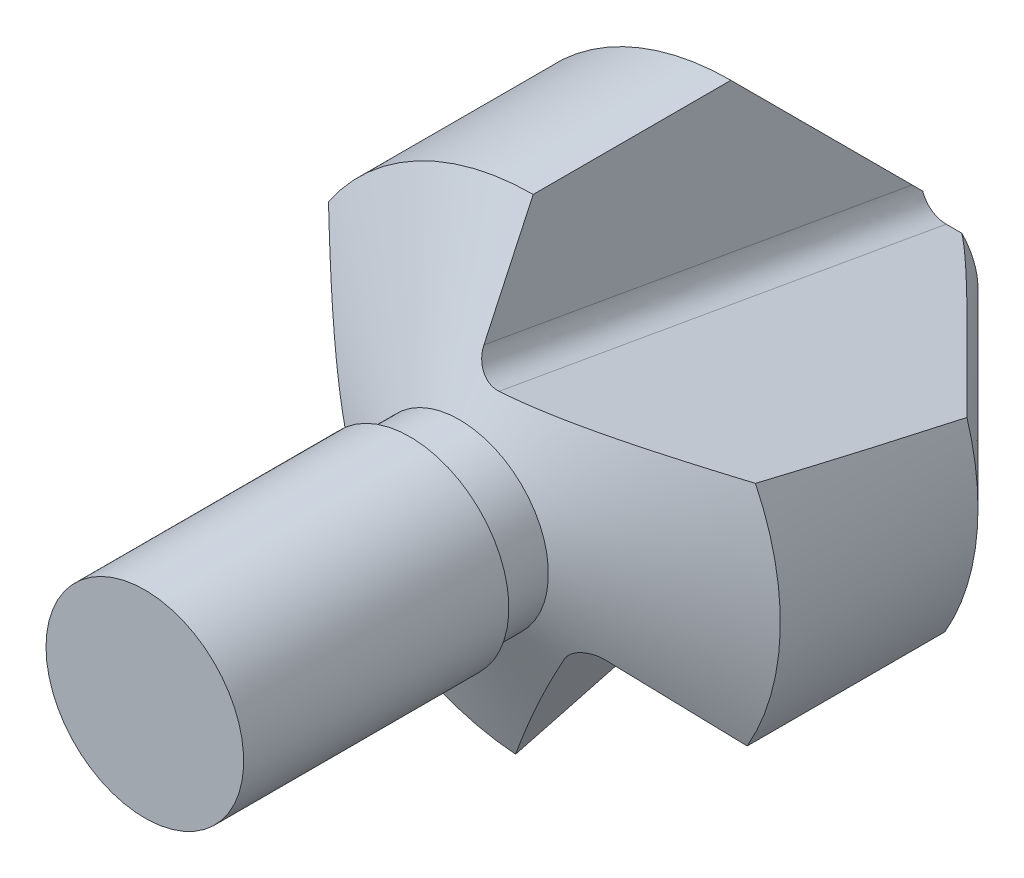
ISO-10303-21;
HEADER;
FILE_DESCRIPTION(('STEP AP214'),'2;1');
FILE_NAME('part.step','',(''),(''),'','','');
FILE_SCHEMA(('AUTOMOTIVE_DESIGN { 1 0 10303 214 1 1 1 1 }'));
ENDSEC;
DATA;
#1=APPLICATION_CONTEXT('core data for automotive mechanical design processes');
#2=APPLICATION_PROTOCOL_DEFINITION('international standard','automotive_design',2000,#1);
#3=PRODUCT_CONTEXT('',#1,'mechanical');
#4=PRODUCT('Part','Part','',(#3));
#5=PRODUCT_RELATED_PRODUCT_CATEGORY('part','',(#4));
#6=PRODUCT_DEFINITION_FORMATION('','',#4);
#7=PRODUCT_DEFINITION_CONTEXT('part definition',#1,'design');
#8=PRODUCT_DEFINITION('design','',#6,#7);
#9=PRODUCT_DEFINITION_SHAPE('','',#8);
#10=(LENGTH_UNIT() NAMED_UNIT(*) SI_UNIT(.MILLI.,.METRE.));
#11=(NAMED_UNIT(*) PLANE_ANGLE_UNIT() SI_UNIT($,.RADIAN.));
#12=(NAMED_UNIT(*) SI_UNIT($,.STERADIAN.) SOLID_ANGLE_UNIT());
#13=UNCERTAINTY_MEASURE_WITH_UNIT(LENGTH_MEASURE(1.E-05),#10,'distance_accuracy_value','');
#14=(GEOMETRIC_REPRESENTATION_CONTEXT(3) GLOBAL_UNCERTAINTY_ASSIGNED_CONTEXT((#13)) GLOBAL_UNIT_ASSIGNED_CONTEXT((#10,
#11,#12)) REPRESENTATION_CONTEXT('',''));
#15=CARTESIAN_POINT('',(0.,0.,0.));
#16=DIRECTION('',(0.,0.,1.));
#17=DIRECTION('',(1.,0.,0.));
#18=AXIS2_PLACEMENT_3D('',#15,#16,#17);
#19=CARTESIAN_POINT('',(0.,0.,-7.14285714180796E-08));
#20=DIRECTION('',(0.,0.,1.));
#21=DIRECTION('',(1.,0.,0.));
#22=AXIS2_PLACEMENT_3D('',#19,#20,#21);
#23=CONICAL_SURFACE('',#22,0.114285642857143,0.78539816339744);
#24=DIRECTION('',(0.612372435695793,0.353553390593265,-0.707106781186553));
#25=VECTOR('',#24,1.);
#26=CARTESIAN_POINT('',(0.,0.,-0.114285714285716));
#27=LINE('',#26,#25);
#28=CARTESIAN_POINT('',(-0.115496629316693,-0.0666820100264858,0.01907830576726));
#29=VERTEX_POINT('',#28);
#30=CARTESIAN_POINT('',(-0.433012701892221,-0.249999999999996,0.385714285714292));
#31=VERTEX_POINT('',#30);
#32=EDGE_CURVE('E202',#29,#31,#27,.F.);
#33=ORIENTED_EDGE('',*,*,#32,.F.);
#34=CARTESIAN_POINT('',(-0.100221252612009,-0.0549263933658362,-7.14285874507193E-08));
#35=CARTESIAN_POINT('',(-0.102285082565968,-0.056999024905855,0.00281137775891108));
#36=CARTESIAN_POINT('',(-0.104443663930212,-0.0589280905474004,0.00563666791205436));
#37=CARTESIAN_POINT('',(-0.109485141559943,-0.062922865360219,0.0119887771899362));
#38=CARTESIAN_POINT('',(-0.112418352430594,-0.0649123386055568,0.0155229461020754));
#39=CARTESIAN_POINT('',(-0.115496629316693,-0.0666820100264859,0.0190783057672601));
#40=B_SPLINE_CURVE_WITH_KNOTS('',3,(#34,#35,#36,#37,#38,#39),.UNSPECIFIED.,.F.,.F.,(4,2,4),(0.,
0.0121353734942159,0.0271509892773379),.UNSPECIFIED.);
#41=CARTESIAN_POINT('',(-0.100221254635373,-0.0549263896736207,0.));
#42=VERTEX_POINT('',#41);
#43=EDGE_CURVE('E195',#42,#29,#40,.T.);
#44=ORIENTED_EDGE('',*,*,#43,.F.);
#45=CARTESIAN_POINT('',(0.,0.,-7.14285714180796E-08));
#46=DIRECTION('',(0.,0.,-1.));
#47=DIRECTION('',(-1.,0.,0.));
#48=AXIS2_PLACEMENT_3D('',#45,#46,#47);
#49=CIRCLE('',#48,0.114285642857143);
#50=CARTESIAN_POINT('',(0.0284739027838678,-0.110681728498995,-7.14285714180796E-08));
#51=VERTEX_POINT('',#50);
#52=EDGE_CURVE('E159',#51,#42,#49,.T.);
#53=ORIENTED_EDGE('',*,*,#52,.F.);
#54=CARTESIAN_POINT('',(-0.110681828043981,-0.487800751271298,0.385914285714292));
#55=CARTESIAN_POINT('',(-0.1050613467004,-0.472294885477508,0.369550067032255));
#56=CARTESIAN_POINT('',(-0.0994371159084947,-0.456784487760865,0.353191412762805));
#57=CARTESIAN_POINT('',(-0.0881767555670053,-0.425749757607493,0.320493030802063));
#58=CARTESIAN_POINT('',(-0.0825406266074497,-0.410225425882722,0.304153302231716));
#59=CARTESIAN_POINT('',(-0.0712527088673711,-0.37915970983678,0.271502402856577));
#60=CARTESIAN_POINT('',(-0.0656009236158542,-0.363618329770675,0.255191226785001));
#61=CARTESIAN_POINT('',(-0.0542718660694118,-0.332504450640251,0.222605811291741));
#62=CARTESIAN_POINT('',(-0.0485945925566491,-0.316931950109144,0.206331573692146));
#63=CARTESIAN_POINT('',(-0.0371976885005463,-0.285732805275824,0.17383760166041));
#64=CARTESIAN_POINT('',(-0.0314780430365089,-0.270106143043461,0.15761788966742));
#65=CARTESIAN_POINT('',(-0.0199710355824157,-0.238772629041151,0.125283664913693));
#66=CARTESIAN_POINT('',(-0.0141836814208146,-0.223065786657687,0.109169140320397));
#67=CARTESIAN_POINT('',(-0.00539907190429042,-0.199380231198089,0.0851507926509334));
#68=CARTESIAN_POINT('',(-0.0024529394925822,-0.191462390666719,0.0771684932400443));
#69=CARTESIAN_POINT('',(0.00349255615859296,-0.175564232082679,0.061288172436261));
#70=CARTESIAN_POINT('',(0.00649191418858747,-0.167583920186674,0.0533901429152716));
#71=CARTESIAN_POINT('',(0.0125722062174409,-0.151525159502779,0.0377164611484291));
#72=CARTESIAN_POINT('',(0.0156531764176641,-0.143446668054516,0.0299408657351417));
#73=CARTESIAN_POINT('',(0.0219726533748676,-0.127106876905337,0.0146450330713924));
#74=CARTESIAN_POINT('',(0.0252112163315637,-0.118845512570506,0.00712488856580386));
#75=CARTESIAN_POINT('',(0.0285661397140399,-0.11045146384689,-0.000199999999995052));
#76=B_SPLINE_CURVE_WITH_KNOTS('',3,(#54,#55,#56,#57,#58,#59,#60,#61,#62,#63,#64,#65,#66,#67,#68,
#69,#70,#71,#72,#73,#74,#75),.UNSPECIFIED.,.F.,.F.,(4,2,2,2,2,2,2,2,2,2,4),(0.,
0.0697014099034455,0.139399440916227,0.209082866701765,0.278769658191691,0.348482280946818,
0.418186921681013,0.453054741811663,0.487919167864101,0.522799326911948,0.557692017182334),.UNSPECIFIED.);
#77=CARTESIAN_POINT('',(-0.110613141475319,-0.487611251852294,0.385714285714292));
#78=VERTEX_POINT('',#77);
#79=EDGE_CURVE('E57',#78,#51,#76,.T.);
#80=ORIENTED_EDGE('',*,*,#79,.F.);
#81=CARTESIAN_POINT('',(0.,0.,0.385714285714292));
#82=DIRECTION('',(0.,0.,-1.));
#83=DIRECTION('',(-1.,0.,0.));
#84=AXIS2_PLACEMENT_3D('',#81,#82,#83);
#85=CIRCLE('',#84,0.5);
#86=EDGE_CURVE('E292',#78,#31,#85,.T.);
#87=ORIENTED_EDGE('',*,*,#86,.T.);
#88=EDGE_LOOP('',(#33,#44,#53,#80,#87));
#89=FACE_BOUND('',#88,.T.);
#90=ADVANCED_FACE('F33',(#89),#23,.T.);
#91=CARTESIAN_POINT('',(0.,0.,-0.140668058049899));
#92=DIRECTION('',(0.,0.,-1.));
#93=DIRECTION('',(-1.,0.,0.));
#94=AXIS2_PLACEMENT_3D('',#91,#92,#93);
#95=CYLINDRICAL_SURFACE('',#94,0.5);
#96=DIRECTION('',(0.,0.,-1.));
#97=VECTOR('',#96,1.);
#98=CARTESIAN_POINT('',(-0.433012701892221,-0.249999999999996,-0.140668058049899));
#99=LINE('',#98,#97);
#100=CARTESIAN_POINT('',(-0.433012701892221,-0.249999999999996,0.785714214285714));
#101=VERTEX_POINT('',#100);
#102=EDGE_CURVE('E200',#31,#101,#99,.F.);
#103=ORIENTED_EDGE('',*,*,#102,.F.);
#104=ORIENTED_EDGE('',*,*,#86,.F.);
#105=CARTESIAN_POINT('',(0.,0.,-0.453702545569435));
#106=DIRECTION('',(-0.852868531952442,0.492403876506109,0.173648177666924));
#107=DIRECTION('',(-0.150383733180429,0.0868240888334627,-0.984807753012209));
#108=AXIS2_PLACEMENT_3D('',#105,#106,#107);
#109=ELLIPSE('',#108,2.87938524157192,0.5);
#110=CARTESIAN_POINT('',(-0.0355915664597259,-0.498731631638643,0.785714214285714));
#111=VERTEX_POINT('',#110);
#112=EDGE_CURVE('E317',#111,#78,#109,.F.);
#113=ORIENTED_EDGE('',*,*,#112,.F.);
#114=CARTESIAN_POINT('',(0.,0.,0.785714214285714));
#115=DIRECTION('',(0.,0.,-1.));
#116=DIRECTION('',(-1.,0.,0.));
#117=AXIS2_PLACEMENT_3D('',#114,#115,#116);
#118=CIRCLE('',#117,0.5);
#119=EDGE_CURVE('E287',#111,#101,#118,.T.);
#120=ORIENTED_EDGE('',*,*,#119,.T.);
#121=EDGE_LOOP('',(#103,#104,#113,#120));
#122=FACE_BOUND('',#121,.T.);
#123=ADVANCED_FACE('F373',(#122),#95,.T.);
#124=DIRECTION('',(-0.612372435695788,0.353553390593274,-0.707106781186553));
#125=VECTOR('',#124,1.);
#126=CARTESIAN_POINT('',(0.,0.,-0.114285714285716));
#127=LINE('',#126,#125);
#128=CARTESIAN_POINT('',(0.115496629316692,-0.0666820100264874,0.01907830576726));
#129=VERTEX_POINT('',#128);
#130=CARTESIAN_POINT('',(0.433012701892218,-0.250000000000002,0.385714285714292));
#131=VERTEX_POINT('',#130);
#132=EDGE_CURVE('E231',#129,#131,#127,.F.);
#133=ORIENTED_EDGE('',*,*,#132,.F.);
#134=CARTESIAN_POINT('',(0.097678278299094,-0.0593309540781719,-7.14285891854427E-08));
#135=CARTESIAN_POINT('',(0.100505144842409,-0.060081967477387,0.00281137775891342));
#136=CARTESIAN_POINT('',(0.103255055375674,-0.0609868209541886,0.00563666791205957));
#137=CARTESIAN_POINT('',(0.109235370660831,-0.0633554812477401,0.0119887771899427));
#138=CARTESIAN_POINT('',(0.112424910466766,-0.0649009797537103,0.0155229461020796));
#139=CARTESIAN_POINT('',(0.115496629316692,-0.0666820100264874,0.0190783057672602));
#140=B_SPLINE_CURVE_WITH_KNOTS('',3,(#134,#135,#136,#137,#138,#139),.UNSPECIFIED.,.F.,.F.,(4,2,
4),(0.,0.0121353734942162,0.0271509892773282),.UNSPECIFIED.);
#141=CARTESIAN_POINT('',(0.0976782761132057,-0.0593309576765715,0.));
#142=VERTEX_POINT('',#141);
#143=EDGE_CURVE('E224',#142,#129,#140,.T.);
#144=ORIENTED_EDGE('',*,*,#143,.F.);
#145=CARTESIAN_POINT('',(0.0816162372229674,0.0799999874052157,-7.14285714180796E-08));
#146=VERTEX_POINT('',#145);
#147=EDGE_CURVE('E267',#146,#142,#49,.T.);
#148=ORIENTED_EDGE('',*,*,#147,.F.);
#149=CARTESIAN_POINT('',(0.477788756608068,0.148047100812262,0.385914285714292));
#150=CARTESIAN_POINT('',(0.461550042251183,0.145161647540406,0.369550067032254));
#151=CARTESIAN_POINT('',(0.445305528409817,0.14227717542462,0.353191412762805));
#152=CARTESIAN_POINT('',(0.412798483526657,0.13651156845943,0.320493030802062));
#153=CARTESIAN_POINT('',(0.39653595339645,0.133630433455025,0.304153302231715));
#154=CARTESIAN_POINT('',(0.363988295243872,0.127873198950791,0.271502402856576));
#155=CARTESIAN_POINT('',(0.347703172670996,0.124997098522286,0.255191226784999));
#156=CARTESIAN_POINT('',(0.315093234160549,0.119251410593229,0.222605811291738));
#157=CARTESIAN_POINT('',(0.298768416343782,0.11638182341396,0.206331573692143));
#158=CARTESIAN_POINT('',(0.266050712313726,0.110652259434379,0.173837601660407));
#159=CARTESIAN_POINT('',(0.249657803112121,0.107792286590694,0.157617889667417));
#160=CARTESIAN_POINT('',(0.216768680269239,0.102090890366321,0.125283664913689));
#161=CARTESIAN_POINT('',(0.20027247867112,0.0992494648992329,0.109169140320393));
#162=CARTESIAN_POINT('',(0.1753678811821,0.0950143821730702,0.0851507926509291));
#163=CARTESIAN_POINT('',(0.167037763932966,0.0936068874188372,0.0771684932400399));
#164=CARTESIAN_POINT('',(0.150296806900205,0.0908067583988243,0.0612881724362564));
#165=CARTESIAN_POINT('',(0.141885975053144,0.0894141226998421,0.0533901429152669));
#166=CARTESIAN_POINT('',(0.124938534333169,0.0866504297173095,0.0377164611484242));
#167=CARTESIAN_POINT('',(0.116401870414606,0.0852793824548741,0.0299408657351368));
#168=CARTESIAN_POINT('',(0.0990914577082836,0.0825823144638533,0.0146450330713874));
#169=CARTESIAN_POINT('',(0.0903176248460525,0.0812563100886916,0.00712488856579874));
#170=CARTESIAN_POINT('',(0.0813707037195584,0.0799647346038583,-0.00020000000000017));
#171=B_SPLINE_CURVE_WITH_KNOTS('',3,(#149,#150,#151,#152,#153,#154,#155,#156,#157,#158,#159,
#160,#161,#162,#163,#164,#165,#166,#167,#168,#169,#170),.UNSPECIFIED.,.F.,.F.,(4,2,2,2,2,2,2,2,
2,2,4),(0.,0.0697014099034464,0.139399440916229,0.209082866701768,0.278769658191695,
0.348482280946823,0.418186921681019,0.453054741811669,0.487919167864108,0.522799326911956,
0.557692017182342),.UNSPECIFIED.);
#172=CARTESIAN_POINT('',(0.477590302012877,0.148011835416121,0.385714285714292));
#173=VERTEX_POINT('',#172);
#174=EDGE_CURVE('E339',#173,#146,#171,.T.);
#175=ORIENTED_EDGE('',*,*,#174,.F.);
#176=EDGE_CURVE('E288',#173,#131,#85,.T.);
#177=ORIENTED_EDGE('',*,*,#176,.T.);
#178=EDGE_LOOP('',(#133,#144,#148,#175,#177));
#179=FACE_BOUND('',#178,.T.);
#180=ADVANCED_FACE('F330',(#179),#23,.T.);
#181=DIRECTION('',(0.,0.,-1.));
#182=VECTOR('',#181,1.);
#183=CARTESIAN_POINT('',(0.433012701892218,-0.250000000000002,-0.140668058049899));
#184=LINE('',#183,#182);
#185=CARTESIAN_POINT('',(0.433012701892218,-0.250000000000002,0.785714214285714));
#186=VERTEX_POINT('',#185);
#187=EDGE_CURVE('E229',#131,#186,#184,.F.);
#188=ORIENTED_EDGE('',*,*,#187,.F.);
#189=ORIENTED_EDGE('',*,*,#176,.F.);
#190=CARTESIAN_POINT('',(0.,0.,-0.453702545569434));
#191=DIRECTION('',(0.,-0.984807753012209,0.173648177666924));
#192=DIRECTION('',(0.,-0.173648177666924,-0.984807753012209));
#193=AXIS2_PLACEMENT_3D('',#190,#191,#192);
#194=ELLIPSE('',#193,2.87938524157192,0.5);
#195=CARTESIAN_POINT('',(0.449710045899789,0.218542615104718,0.785714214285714));
#196=VERTEX_POINT('',#195);
#197=EDGE_CURVE('E341',#196,#173,#194,.F.);
#198=ORIENTED_EDGE('',*,*,#197,.F.);
#199=EDGE_CURVE('E283',#196,#186,#118,.T.);
#200=ORIENTED_EDGE('',*,*,#199,.T.);
#201=EDGE_LOOP('',(#188,#189,#198,#200));
#202=FACE_BOUND('',#201,.T.);
#203=ADVANCED_FACE('F380',(#202),#95,.T.);
#204=CARTESIAN_POINT('',(-0.367106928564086,0.339753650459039,0.385914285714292));
#205=CARTESIAN_POINT('',(-0.356488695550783,0.327133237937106,0.369550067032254));
#206=CARTESIAN_POINT('',(-0.345868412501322,0.314507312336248,0.353191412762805));
#207=CARTESIAN_POINT('',(-0.324621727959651,0.289238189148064,0.320493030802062));
#208=CARTESIAN_POINT('',(-0.313995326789,0.276594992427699,0.304153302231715));
#209=CARTESIAN_POINT('',(-0.2927355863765,0.25128651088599,0.271502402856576));
#210=CARTESIAN_POINT('',(-0.282102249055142,0.23862123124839,0.255191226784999));
#211=CARTESIAN_POINT('',(-0.260821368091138,0.213253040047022,0.222605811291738));
#212=CARTESIAN_POINT('',(-0.250173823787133,0.200550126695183,0.206331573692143));
#213=CARTESIAN_POINT('',(-0.22885302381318,0.175080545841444,0.173837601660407));
#214=CARTESIAN_POINT('',(-0.218179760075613,0.162313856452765,0.157617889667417));
#215=CARTESIAN_POINT('',(-0.196797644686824,0.136681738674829,0.125283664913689));
#216=CARTESIAN_POINT('',(-0.186088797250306,0.123816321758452,0.109169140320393));
#217=CARTESIAN_POINT('',(-0.169968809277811,0.104365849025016,0.085150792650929));
#218=CARTESIAN_POINT('',(-0.164584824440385,0.0978555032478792,0.0771684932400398));
#219=CARTESIAN_POINT('',(-0.1537893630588,0.084757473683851,0.0612881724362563));
#220=CARTESIAN_POINT('',(-0.148377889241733,0.0781697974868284,0.0533901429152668));
#221=CARTESIAN_POINT('',(-0.137510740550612,0.0648747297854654,0.0377164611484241));
#222=CARTESIAN_POINT('',(-0.132055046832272,0.0581672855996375,0.0299408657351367));
#223=CARTESIAN_POINT('',(-0.121064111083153,0.0445245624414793,0.0146450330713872));
#224=CARTESIAN_POINT('',(-0.115528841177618,0.0375892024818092,0.00712488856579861));
#225=CARTESIAN_POINT('',(-0.109936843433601,0.0304867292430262,-0.000200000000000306));
#226=B_SPLINE_CURVE_WITH_KNOTS('',3,(#204,#205,#206,#207,#208,#209,#210,#211,#212,#213,#214,
#215,#216,#217,#218,#219,#220,#221,#222,#223,#224,#225),.UNSPECIFIED.,.F.,.F.,(4,2,2,2,2,2,2,2,
2,2,4),(0.,0.0697014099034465,0.13939944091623,0.209082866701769,0.278769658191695,
0.348482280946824,0.418186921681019,0.453054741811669,0.487919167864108,0.522799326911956,
0.557692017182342),.UNSPECIFIED.);
#227=CARTESIAN_POINT('',(-0.366977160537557,0.339599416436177,0.385714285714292));
#228=VERTEX_POINT('',#227);
#229=CARTESIAN_POINT('',(-0.110090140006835,0.03068174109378,-7.14285714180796E-08));
#230=VERTEX_POINT('',#229);
#231=EDGE_CURVE('E49',#228,#230,#226,.T.);
#232=ORIENTED_EDGE('',*,*,#231,.F.);
#233=CARTESIAN_POINT('',(0.,0.5,0.385714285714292));
#234=VERTEX_POINT('',#233);
#235=EDGE_CURVE('E286',#228,#234,#85,.T.);
#236=ORIENTED_EDGE('',*,*,#235,.T.);
#237=DIRECTION('',(0.,-0.707106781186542,-0.707106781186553));
#238=VECTOR('',#237,1.);
#239=CARTESIAN_POINT('',(0.,0.,-0.114285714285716));
#240=LINE('',#239,#238);
#241=CARTESIAN_POINT('',(0.,0.133364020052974,0.0190783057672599));
#242=VERTEX_POINT('',#241);
#243=EDGE_CURVE('E263',#242,#234,#240,.F.);
#244=ORIENTED_EDGE('',*,*,#243,.F.);
#245=CARTESIAN_POINT('',(0.00254297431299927,0.114257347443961,-7.14285807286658E-08));
#246=CARTESIAN_POINT('',(0.00177993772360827,0.117080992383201,0.00281137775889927));
#247=CARTESIAN_POINT('',(0.00118860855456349,0.119914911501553,0.00563666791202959));
#248=CARTESIAN_POINT('',(0.000249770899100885,0.12627834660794,0.0119887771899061));
#249=CARTESIAN_POINT('',(-6.55803618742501E-06,0.129813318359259,0.0155229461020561));
#250=CARTESIAN_POINT('',(0.,0.133364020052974,0.0190783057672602));
#251=B_SPLINE_CURVE_WITH_KNOTS('',3,(#245,#246,#247,#248,#249,#250),.UNSPECIFIED.,.F.,.F.,(4,2,
4),(0.,0.0121353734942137,0.027150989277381),.UNSPECIFIED.);
#252=CARTESIAN_POINT('',(0.00254297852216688,0.114257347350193,0.));
#253=VERTEX_POINT('',#252);
#254=EDGE_CURVE('E255',#253,#242,#251,.T.);
#255=ORIENTED_EDGE('',*,*,#254,.F.);
#256=EDGE_CURVE('E266',#230,#253,#49,.T.);
#257=ORIENTED_EDGE('',*,*,#256,.F.);
#258=EDGE_LOOP('',(#232,#236,#244,#255,#257));
#259=FACE_BOUND('',#258,.T.);
#260=ADVANCED_FACE('F35',(#259),#23,.T.);
#261=CARTESIAN_POINT('',(0.,0.,-0.453702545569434));
#262=DIRECTION('',(0.852868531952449,0.492403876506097,0.173648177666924));
#263=DIRECTION('',(0.15038373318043,0.0868240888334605,-0.984807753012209));
#264=AXIS2_PLACEMENT_3D('',#261,#262,#263);
#265=ELLIPSE('',#264,2.87938524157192,0.5);
#266=CARTESIAN_POINT('',(-0.414118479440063,0.280189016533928,0.785714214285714));
#267=VERTEX_POINT('',#266);
#268=EDGE_CURVE('E173',#267,#228,#265,.F.);
#269=ORIENTED_EDGE('',*,*,#268,.F.);
#270=CARTESIAN_POINT('',(0.,0.5,0.785714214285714));
#271=VERTEX_POINT('',#270);
#272=EDGE_CURVE('E282',#267,#271,#118,.T.);
#273=ORIENTED_EDGE('',*,*,#272,.T.);
#274=DIRECTION('',(0.,0.,-1.));
#275=VECTOR('',#274,1.);
#276=CARTESIAN_POINT('',(0.,0.5,-0.140668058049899));
#277=LINE('',#276,#275);
#278=EDGE_CURVE('E260',#234,#271,#277,.F.);
#279=ORIENTED_EDGE('',*,*,#278,.F.);
#280=ORIENTED_EDGE('',*,*,#235,.F.);
#281=EDGE_LOOP('',(#269,#273,#279,#280));
#282=FACE_BOUND('',#281,.T.);
#283=ADVANCED_FACE('F378',(#282),#95,.T.);
#284=CARTESIAN_POINT('',(0.,0.,0.785714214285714));
#285=DIRECTION('',(0.,0.,-1.));
#286=DIRECTION('',(-1.,0.,0.));
#287=AXIS2_PLACEMENT_3D('',#284,#285,#286);
#288=CONICAL_SURFACE('',#287,0.5,1.13446401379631);
#289=DIRECTION('',(-0.784885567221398,-0.453153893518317,-0.422618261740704));
#290=VECTOR('',#289,1.);
#291=CARTESIAN_POINT('',(0.,0.,1.01886804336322));
#292=LINE('',#291,#290);
#293=CARTESIAN_POINT('',(-0.247793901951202,-0.143063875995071,0.885444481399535));
#294=VERTEX_POINT('',#293);
#295=EDGE_CURVE('E11',#101,#294,#292,.F.);
#296=ORIENTED_EDGE('',*,*,#295,.F.);
#297=ORIENTED_EDGE('',*,*,#119,.F.);
#298=CARTESIAN_POINT('',(0.228738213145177,-0.0831012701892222,0.905384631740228));
#299=CARTESIAN_POINT('',(0.220820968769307,-0.0972561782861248,0.906637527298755));
#300=CARTESIAN_POINT('',(0.212763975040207,-0.111390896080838,0.907146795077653));
#301=CARTESIAN_POINT('',(0.196468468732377,-0.13947857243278,0.906758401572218));
#302=CARTESIAN_POINT('',(0.188230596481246,-0.153431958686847,0.905865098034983));
#303=CARTESIAN_POINT('',(0.171710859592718,-0.180955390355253,0.902775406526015));
#304=CARTESIAN_POINT('',(0.163430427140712,-0.194527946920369,0.900593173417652));
#305=CARTESIAN_POINT('',(0.146798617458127,-0.221424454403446,0.895175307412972));
#306=CARTESIAN_POINT('',(0.138447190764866,-0.234748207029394,0.891938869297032));
#307=CARTESIAN_POINT('',(0.116389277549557,-0.269569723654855,0.882343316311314));
#308=CARTESIAN_POINT('',(0.102662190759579,-0.290864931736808,0.875308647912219));
#309=CARTESIAN_POINT('',(0.0752122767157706,-0.332985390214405,0.859927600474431));
#310=CARTESIAN_POINT('',(0.0614894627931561,-0.353810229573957,0.851580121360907));
#311=CARTESIAN_POINT('',(0.0337948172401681,-0.395547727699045,0.833911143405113));
#312=CARTESIAN_POINT('',(0.0198234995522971,-0.416453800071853,0.824573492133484));
#313=CARTESIAN_POINT('',(-0.00805861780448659,-0.457975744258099,0.805372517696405));
#314=CARTESIAN_POINT('',(-0.0219694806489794,-0.478592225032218,0.795510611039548));
#315=CARTESIAN_POINT('',(-0.0358690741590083,-0.499141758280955,0.785514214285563));
#316=B_SPLINE_CURVE_WITH_KNOTS('',3,(#298,#299,#300,#301,#302,#303,#304,#305,#306,#307,#308,
#309,#310,#311,#312,#313,#314,#315),.UNSPECIFIED.,.F.,.F.,(4,2,2,2,2,2,2,2,4),(0.,
0.0487740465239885,0.0973968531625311,0.145495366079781,0.193630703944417,0.27244484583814,
0.351325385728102,0.431784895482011,0.51203708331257),.UNSPECIFIED.);
#317=CARTESIAN_POINT('',(0.182442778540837,-0.163068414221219,0.904763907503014));
#318=VERTEX_POINT('',#317);
#319=EDGE_CURVE('E311',#318,#111,#316,.T.);
#320=ORIENTED_EDGE('',*,*,#319,.F.);
#321=CARTESIAN_POINT('',(0.2477939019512,-0.143063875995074,0.885444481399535));
#322=CARTESIAN_POINT('',(0.245546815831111,-0.141764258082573,0.886654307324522));
#323=CARTESIAN_POINT('',(0.243180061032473,-0.14067331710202,0.887865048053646));
#324=CARTESIAN_POINT('',(0.238273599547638,-0.138930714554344,0.890251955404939));
#325=CARTESIAN_POINT('',(0.235733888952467,-0.138279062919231,0.891428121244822));
#326=CARTESIAN_POINT('',(0.230568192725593,-0.137440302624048,0.893700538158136));
#327=CARTESIAN_POINT('',(0.227943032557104,-0.137249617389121,0.894797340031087));
#328=CARTESIAN_POINT('',(0.222693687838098,-0.137330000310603,0.89686813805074));
#329=CARTESIAN_POINT('',(0.220069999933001,-0.137594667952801,0.897843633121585));
#330=CARTESIAN_POINT('',(0.214902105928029,-0.138562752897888,0.899635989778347));
#331=CARTESIAN_POINT('',(0.212357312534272,-0.139258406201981,0.900455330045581));
#332=CARTESIAN_POINT('',(0.207413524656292,-0.141051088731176,0.901908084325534));
#333=CARTESIAN_POINT('',(0.205012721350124,-0.142140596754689,0.902544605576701));
#334=CARTESIAN_POINT('',(0.200407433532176,-0.144677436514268,0.903614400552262));
#335=CARTESIAN_POINT('',(0.198200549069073,-0.146119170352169,0.90405057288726));
#336=CARTESIAN_POINT('',(0.194022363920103,-0.149317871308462,0.904709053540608));
#337=CARTESIAN_POINT('',(0.192049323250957,-0.151072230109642,0.904933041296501));
#338=CARTESIAN_POINT('',(0.187243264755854,-0.156010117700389,0.905237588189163));
#339=CARTESIAN_POINT('',(0.184620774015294,-0.159412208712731,0.905147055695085));
#340=CARTESIAN_POINT('',(0.182442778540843,-0.163068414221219,0.90476390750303));
#341=B_SPLINE_CURVE_WITH_KNOTS('',3,(#321,#322,#323,#324,#325,#326,#327,#328,#329,#330,#331,
#332,#333,#334,#335,#336,#337,#338,#339,#340),.UNSPECIFIED.,.F.,.F.,(4,2,2,2,2,2,2,2,2,4),(0.,
0.0085815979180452,0.0171633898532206,0.0256783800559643,0.0340746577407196,0.0423239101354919,
0.0504233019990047,0.0584015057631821,0.0663160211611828,0.0790632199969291),.UNSPECIFIED.);
#342=CARTESIAN_POINT('',(0.2477939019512,-0.143063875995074,0.885444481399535));
#343=VERTEX_POINT('',#342);
#344=EDGE_CURVE('E218',#343,#318,#341,.T.);
#345=ORIENTED_EDGE('',*,*,#344,.F.);
#346=DIRECTION('',(0.784885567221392,-0.453153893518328,-0.422618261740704));
#347=VECTOR('',#346,1.);
#348=CARTESIAN_POINT('',(0.,0.,1.01886804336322));
#349=LINE('',#348,#347);
#350=EDGE_CURVE('E155',#186,#343,#349,.F.);
#351=ORIENTED_EDGE('',*,*,#350,.F.);
#352=ORIENTED_EDGE('',*,*,#199,.F.);
#353=CARTESIAN_POINT('',(0.0498,0.239537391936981,0.904781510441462));
#354=CARTESIAN_POINT('',(0.0708939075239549,0.239211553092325,0.902933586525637));
#355=CARTESIAN_POINT('',(0.0918315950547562,0.23868470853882,0.899945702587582));
#356=CARTESIAN_POINT('',(0.133318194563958,0.237326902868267,0.892245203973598));
#357=CARTESIAN_POINT('',(0.153868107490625,0.236496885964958,0.887537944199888));
#358=CARTESIAN_POINT('',(0.194531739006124,0.234632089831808,0.876962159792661));
#359=CARTESIAN_POINT('',(0.214647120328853,0.233598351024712,0.871099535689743));
#360=CARTESIAN_POINT('',(0.254635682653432,0.23139022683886,0.858576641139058));
#361=CARTESIAN_POINT('',(0.274508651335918,0.230215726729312,0.851915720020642));
#362=CARTESIAN_POINT('',(0.32050204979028,0.227375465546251,0.835807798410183));
#363=CARTESIAN_POINT('',(0.346548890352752,0.225674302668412,0.826160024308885));
#364=CARTESIAN_POINT('',(0.398488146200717,0.22215964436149,0.806227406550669));
#365=CARTESIAN_POINT('',(0.424379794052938,0.220345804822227,0.795940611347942));
#366=CARTESIAN_POINT('',(0.450203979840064,0.218507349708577,0.785514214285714));
#367=B_SPLINE_CURVE_WITH_KNOTS('',3,(#353,#354,#355,#356,#357,#358,#359,#360,#361,#362,#363,
#364,#365,#366),.UNSPECIFIED.,.F.,.F.,(4,2,2,2,2,2,4),(0.,0.0634240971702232,0.12665232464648,
0.189565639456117,0.252530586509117,0.33600559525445,0.419749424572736),.UNSPECIFIED.);
#368=CARTESIAN_POINT('',(0.05,0.239534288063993,0.904763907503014));
#369=VERTEX_POINT('',#368);
#370=EDGE_CURVE('E343',#369,#196,#367,.T.);
#371=ORIENTED_EDGE('',*,*,#370,.F.);
#372=CARTESIAN_POINT('',(0.,0.286127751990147,0.885444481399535));
#373=CARTESIAN_POINT('',(-1.95906739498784E-06,0.283531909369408,0.886654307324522));
#374=CARTESIAN_POINT('',(0.000236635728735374,0.280936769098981,0.887865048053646));
#375=CARTESIAN_POINT('',(0.00118072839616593,0.275816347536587,0.890251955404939));
#376=CARTESIAN_POINT('',(0.00188623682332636,0.273291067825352,0.891428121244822));
#377=CARTESIAN_POINT('',(0.00374269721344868,0.268398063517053,0.893700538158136));
#378=CARTESIAN_POINT('',(0.00489013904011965,0.266029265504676,0.894797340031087));
#379=CARTESIAN_POINT('',(0.00758442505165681,0.261523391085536,0.89686813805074));
#380=CARTESIAN_POINT('',(0.00912547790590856,0.259383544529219,0.897843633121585));
#381=CARTESIAN_POINT('',(0.0125478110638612,0.255392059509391,0.899635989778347));
#382=CARTESIAN_POINT('',(0.0144226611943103,0.253536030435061,0.900455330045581));
#383=CARTESIAN_POINT('',(0.0184470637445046,0.250150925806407,0.901908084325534));
#384=CARTESIAN_POINT('',(0.0205910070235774,0.248616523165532,0.902544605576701));
#385=CARTESIAN_POINT('',(0.0250906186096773,0.24589664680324,0.903614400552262));
#386=CARTESIAN_POINT('',(0.0274426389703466,0.244706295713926,0.90405057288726));
#387=CARTESIAN_POINT('',(0.0323018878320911,0.242687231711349,0.904709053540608));
#388=CARTESIAN_POINT('',(0.0348077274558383,0.241855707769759,0.904933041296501));
#389=CARTESIAN_POINT('',(0.0414870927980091,0.2401624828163,0.905237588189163));
#390=CARTESIAN_POINT('',(0.0457446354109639,0.239592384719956,0.905147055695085));
#391=CARTESIAN_POINT('',(0.0499999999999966,0.239534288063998,0.90476390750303));
#392=B_SPLINE_CURVE_WITH_KNOTS('',3,(#372,#373,#374,#375,#376,#377,#378,#379,#380,#381,#382,
#383,#384,#385,#386,#387,#388,#389,#390,#391),.UNSPECIFIED.,.F.,.F.,(4,2,2,2,2,2,2,2,2,4),(0.,
0.00858159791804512,0.0171633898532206,0.0256783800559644,0.0340746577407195,0.0423239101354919,
0.0504233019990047,0.0584015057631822,0.0663160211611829,0.0790632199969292),.UNSPECIFIED.);
#393=CARTESIAN_POINT('',(0.,0.286127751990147,0.885444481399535));
#394=VERTEX_POINT('',#393);
#395=EDGE_CURVE('E249',#394,#369,#392,.T.);
#396=ORIENTED_EDGE('',*,*,#395,.F.);
#397=DIRECTION('',(0.,0.906307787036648,-0.422618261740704));
#398=VECTOR('',#397,1.);
#399=CARTESIAN_POINT('',(0.,0.,1.01886804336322));
#400=LINE('',#399,#398);
#401=EDGE_CURVE('E295',#271,#394,#400,.F.);
#402=ORIENTED_EDGE('',*,*,#401,.F.);
#403=ORIENTED_EDGE('',*,*,#272,.F.);
#404=CARTESIAN_POINT('',(-0.134847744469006,-0.240415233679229,0.890329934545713));
#405=CARTESIAN_POINT('',(-0.144279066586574,-0.225470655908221,0.894274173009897));
#406=CARTESIAN_POINT('',(-0.153702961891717,-0.210339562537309,0.897653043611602));
#407=CARTESIAN_POINT('',(-0.172441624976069,-0.179760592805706,0.902976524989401));
#408=CARTESIAN_POINT('',(-0.181756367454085,-0.164312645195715,0.904920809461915));
#409=CARTESIAN_POINT('',(-0.199981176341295,-0.133496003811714,0.907046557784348));
#410=CARTESIAN_POINT('',(-0.208895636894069,-0.118132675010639,0.907264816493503));
#411=CARTESIAN_POINT('',(-0.226422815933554,-0.0873303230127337,0.906004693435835));
#412=CARTESIAN_POINT('',(-0.235035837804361,-0.0718913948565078,0.904528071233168));
#413=CARTESIAN_POINT('',(-0.258871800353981,-0.0284044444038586,0.898284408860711));
#414=CARTESIAN_POINT('',(-0.273719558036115,-0.000404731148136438,0.891811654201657));
#415=CARTESIAN_POINT('',(-0.302635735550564,0.0552730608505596,0.875950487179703));
#416=CARTESIAN_POINT('',(-0.316699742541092,0.0829487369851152,0.866547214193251));
#417=CARTESIAN_POINT('',(-0.344970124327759,0.139261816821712,0.845712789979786));
#418=CARTESIAN_POINT('',(-0.359152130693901,0.167883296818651,0.834207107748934));
#419=CARTESIAN_POINT('',(-0.380100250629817,0.210478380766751,0.816308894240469));
#420=CARTESIAN_POINT('',(-0.38699161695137,0.224543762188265,0.810271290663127));
#421=CARTESIAN_POINT('',(-0.400708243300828,0.252623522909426,0.798016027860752));
#422=CARTESIAN_POINT('',(-0.407533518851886,0.266637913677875,0.79179841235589));
#423=CARTESIAN_POINT('',(-0.414334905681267,0.280634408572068,0.785514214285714));
#424=B_SPLINE_CURVE_WITH_KNOTS('',3,(#404,#405,#406,#407,#408,#409,#410,#411,#412,#413,#414,
#415,#416,#417,#418,#419,#420,#421,#422,#423),.UNSPECIFIED.,.F.,.F.,(4,2,2,2,2,2,2,2,2,4),(0.,
0.0543515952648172,0.108715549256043,0.161917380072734,0.215064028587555,0.311818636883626,
0.409072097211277,0.510895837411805,0.56125430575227,0.611600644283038),.UNSPECIFIED.);
#425=CARTESIAN_POINT('',(-0.232442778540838,-0.0764658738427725,0.904763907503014));
#426=VERTEX_POINT('',#425);
#427=EDGE_CURVE('E165',#426,#267,#424,.T.);
#428=ORIENTED_EDGE('',*,*,#427,.F.);
#429=CARTESIAN_POINT('',(-0.247793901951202,-0.143063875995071,0.885444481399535));
#430=CARTESIAN_POINT('',(-0.245544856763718,-0.141767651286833,0.886654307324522));
#431=CARTESIAN_POINT('',(-0.24341669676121,-0.140263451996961,0.887865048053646));
#432=CARTESIAN_POINT('',(-0.239454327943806,-0.136885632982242,0.890251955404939));
#433=CARTESIAN_POINT('',(-0.237620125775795,-0.135012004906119,0.891428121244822));
#434=CARTESIAN_POINT('',(-0.234310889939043,-0.130957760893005,0.893700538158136));
#435=CARTESIAN_POINT('',(-0.232833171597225,-0.128779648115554,0.894797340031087));
#436=CARTESIAN_POINT('',(-0.230278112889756,-0.124193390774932,0.89686813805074));
#437=CARTESIAN_POINT('',(-0.229195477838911,-0.121788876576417,0.897843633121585));
#438=CARTESIAN_POINT('',(-0.227449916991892,-0.116829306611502,0.899635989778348));
#439=CARTESIAN_POINT('',(-0.226779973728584,-0.11427762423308,0.900455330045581));
#440=CARTESIAN_POINT('',(-0.225860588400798,-0.10909983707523,0.901908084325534));
#441=CARTESIAN_POINT('',(-0.225603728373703,-0.106475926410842,0.902544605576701));
#442=CARTESIAN_POINT('',(-0.225498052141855,-0.101219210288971,0.903614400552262));
#443=CARTESIAN_POINT('',(-0.225643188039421,-0.098587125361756,0.90405057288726));
#444=CARTESIAN_POINT('',(-0.226324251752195,-0.0933693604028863,0.904709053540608));
#445=CARTESIAN_POINT('',(-0.226857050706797,-0.0907834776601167,0.904933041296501));
#446=CARTESIAN_POINT('',(-0.228730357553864,-0.0841523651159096,0.905237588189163));
#447=CARTESIAN_POINT('',(-0.230365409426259,-0.080180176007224,0.905147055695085));
#448=CARTESIAN_POINT('',(-0.232442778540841,-0.076465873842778,0.90476390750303));
#449=B_SPLINE_CURVE_WITH_KNOTS('',3,(#429,#430,#431,#432,#433,#434,#435,#436,#437,#438,#439,
#440,#441,#442,#443,#444,#445,#446,#447,#448),.UNSPECIFIED.,.F.,.F.,(4,2,2,2,2,2,2,2,2,4),(0.,
0.0085815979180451,0.0171633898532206,0.0256783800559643,0.0340746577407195,0.0423239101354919,
0.0504233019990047,0.0584015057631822,0.0663160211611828,0.0790632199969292),.UNSPECIFIED.);
#450=EDGE_CURVE('E148',#294,#426,#449,.T.);
#451=ORIENTED_EDGE('',*,*,#450,.F.);
#452=EDGE_LOOP('',(#296,#297,#320,#345,#351,#352,#371,#396,#402,#403,#428,#451));
#453=FACE_BOUND('',#452,.T.);
#454=CARTESIAN_POINT('',(0.,0.,0.934932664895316));
#455=DIRECTION('',(0.,0.,-1.));
#456=DIRECTION('',(-1.,0.,0.));
#457=AXIS2_PLACEMENT_3D('',#454,#455,#456);
#458=CIRCLE('',#457,0.18);
#459=CARTESIAN_POINT('',(-0.18,0.,0.934932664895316));
#460=VERTEX_POINT('',#459);
#461=EDGE_CURVE('E279',#460,#460,#458,.T.);
#462=ORIENTED_EDGE('',*,*,#461,.T.);
#463=EDGE_LOOP('',(#462));
#464=FACE_BOUND('',#463,.T.);
#465=ADVANCED_FACE('F175',(#453,#464),#288,.T.);
#466=CARTESIAN_POINT('',(0.,0.,-0.140668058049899));
#467=DIRECTION('',(0.,0.,-1.));
#468=DIRECTION('',(-1.,0.,0.));
#469=AXIS2_PLACEMENT_3D('',#466,#467,#468);
#470=CYLINDRICAL_SURFACE('',#469,0.18);
#471=CARTESIAN_POINT('',(0.,0.,1.03493266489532));
#472=DIRECTION('',(0.,0.,-1.));
#473=DIRECTION('',(-1.,0.,0.));
#474=AXIS2_PLACEMENT_3D('',#471,#472,#473);
#475=CIRCLE('',#474,0.18);
#476=CARTESIAN_POINT('',(-0.18,0.,1.03493266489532));
#477=VERTEX_POINT('',#476);
#478=EDGE_CURVE('E276',#477,#477,#475,.T.);
#479=ORIENTED_EDGE('',*,*,#478,.T.);
#480=EDGE_LOOP('',(#479));
#481=FACE_BOUND('',#480,.T.);
#482=ORIENTED_EDGE('',*,*,#461,.F.);
#483=EDGE_LOOP('',(#482));
#484=FACE_BOUND('',#483,.T.);
#485=ADVANCED_FACE('F427',(#481,#484),#470,.T.);
#486=CARTESIAN_POINT('',(0.,0.18,1.03493266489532));
#487=DIRECTION('',(0.,0.,-1.));
#488=DIRECTION('',(-1.,0.,0.));
#489=AXIS2_PLACEMENT_3D('',#486,#487,#488);
#490=PLANE('',#489);
#491=CARTESIAN_POINT('',(0.,0.,1.03493266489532));
#492=DIRECTION('',(0.,0.,-1.));
#493=DIRECTION('',(-1.,0.,0.));
#494=AXIS2_PLACEMENT_3D('',#491,#492,#493);
#495=CIRCLE('',#494,0.2);
#496=CARTESIAN_POINT('',(-0.2,0.,1.03493266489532));
#497=VERTEX_POINT('',#496);
#498=EDGE_CURVE('E273',#497,#497,#495,.T.);
#499=ORIENTED_EDGE('',*,*,#498,.T.);
#500=EDGE_LOOP('',(#499));
#501=FACE_BOUND('',#500,.T.);
#502=ORIENTED_EDGE('',*,*,#478,.F.);
#503=EDGE_LOOP('',(#502));
#504=FACE_BOUND('',#503,.T.);
#505=ADVANCED_FACE('F511',(#501,#504),#490,.T.);
#506=CARTESIAN_POINT('',(0.,0.,-0.140668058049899));
#507=DIRECTION('',(0.,0.,-1.));
#508=DIRECTION('',(-1.,0.,0.));
#509=AXIS2_PLACEMENT_3D('',#506,#507,#508);
#510=CYLINDRICAL_SURFACE('',#509,0.2);
#511=CARTESIAN_POINT('',(0.,0.,1.5714285));
#512=DIRECTION('',(0.,0.,-1.));
#513=DIRECTION('',(-1.,0.,0.));
#514=AXIS2_PLACEMENT_3D('',#511,#512,#513);
#515=CIRCLE('',#514,0.2);
#516=CARTESIAN_POINT('',(-0.2,0.,1.5714285));
#517=VERTEX_POINT('',#516);
#518=EDGE_CURVE('E270',#517,#517,#515,.T.);
#519=ORIENTED_EDGE('',*,*,#518,.T.);
#520=EDGE_LOOP('',(#519));
#521=FACE_BOUND('',#520,.T.);
#522=ORIENTED_EDGE('',*,*,#498,.F.);
#523=EDGE_LOOP('',(#522));
#524=FACE_BOUND('',#523,.T.);
#525=ADVANCED_FACE('F500',(#521,#524),#510,.T.);
#526=CARTESIAN_POINT('',(0.,0.2,1.5714285));
#527=DIRECTION('',(0.,0.,1.));
#528=DIRECTION('',(1.,0.,0.));
#529=AXIS2_PLACEMENT_3D('',#526,#527,#528);
#530=PLANE('',#529);
#531=ORIENTED_EDGE('',*,*,#518,.F.);
#532=EDGE_LOOP('',(#531));
#533=FACE_BOUND('',#532,.T.);
#534=ADVANCED_FACE('F437',(#533),#530,.T.);
#535=CARTESIAN_POINT('',(0.,0.114285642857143,-7.14285714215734E-08));
#536=DIRECTION('',(0.,0.,-1.));
#537=DIRECTION('',(-1.,0.,0.));
#538=AXIS2_PLACEMENT_3D('',#535,#536,#537);
#539=PLANE('',#538);
#540=CARTESIAN_POINT('',(-0.137583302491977,-0.0216987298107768,0.));
#541=DIRECTION('',(0.,0.,-1.));
#542=DIRECTION('',(-0.499999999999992,0.866025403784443,0.));
#543=AXIS2_PLACEMENT_3D('',#540,#541,#542);
#544=CIRCLE('',#543,0.05);
#545=CARTESIAN_POINT('',(-0.094282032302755,0.0033012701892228,0.));
#546=VERTEX_POINT('',#545);
#547=EDGE_CURVE('E144',#546,#42,#544,.T.);
#548=ORIENTED_EDGE('',*,*,#547,.F.);
#549=DIRECTION('',(0.499999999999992,-0.866025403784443,0.));
#550=VECTOR('',#549,1.);
#551=CARTESIAN_POINT('',(-0.118769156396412,0.0457142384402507,-7.14285714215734E-08));
#552=LINE('',#551,#550);
#553=EDGE_CURVE('E42',#230,#546,#552,.T.);
#554=ORIENTED_EDGE('',*,*,#553,.F.);
#555=ORIENTED_EDGE('',*,*,#256,.T.);
#556=CARTESIAN_POINT('',(0.05,0.13,0.));
#557=DIRECTION('',(0.,0.,-1.));
#558=DIRECTION('',(1.,0.,0.));
#559=AXIS2_PLACEMENT_3D('',#556,#557,#558);
#560=CIRCLE('',#559,0.05);
#561=CARTESIAN_POINT('',(0.05,0.08,0.));
#562=VERTEX_POINT('',#561);
#563=EDGE_CURVE('E233',#562,#253,#560,.T.);
#564=ORIENTED_EDGE('',*,*,#563,.F.);
#565=DIRECTION('',(-1.,0.,0.));
#566=VECTOR('',#565,1.);
#567=CARTESIAN_POINT('',(0.,0.0799999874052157,-7.14285714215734E-08));
#568=LINE('',#567,#566);
#569=EDGE_CURVE('E291',#146,#562,#568,.T.);
#570=ORIENTED_EDGE('',*,*,#569,.F.);
#571=ORIENTED_EDGE('',*,*,#147,.T.);
#572=CARTESIAN_POINT('',(0.0875833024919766,-0.108301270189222,0.));
#573=DIRECTION('',(0.,0.,-1.));
#574=DIRECTION('',(-0.500000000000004,-0.866025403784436,0.));
#575=AXIS2_PLACEMENT_3D('',#572,#573,#574);
#576=CIRCLE('',#575,0.05);
#577=CARTESIAN_POINT('',(0.0442820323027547,-0.0833012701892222,0.));
#578=VERTEX_POINT('',#577);
#579=EDGE_CURVE('E204',#578,#142,#576,.T.);
#580=ORIENTED_EDGE('',*,*,#579,.F.);
#581=DIRECTION('',(0.500000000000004,0.866025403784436,0.));
#582=VECTOR('',#581,1.);
#583=CARTESIAN_POINT('',(0.118769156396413,0.0457142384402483,-7.14285714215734E-08));
#584=LINE('',#583,#582);
#585=EDGE_CURVE('E297',#51,#578,#584,.T.);
#586=ORIENTED_EDGE('',*,*,#585,.F.);
#587=ORIENTED_EDGE('',*,*,#52,.T.);
#588=EDGE_LOOP('',(#548,#554,#555,#564,#570,#571,#580,#586,#587));
#589=FACE_BOUND('',#588,.T.);
#590=ADVANCED_FACE('F157',(#589),#539,.T.);
#591=CARTESIAN_POINT('',(0.,0.617033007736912,2.76210144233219));
#592=DIRECTION('',(-1.,0.,0.));
#593=DIRECTION('',(0.,-1.,0.));
#594=AXIS2_PLACEMENT_3D('',#591,#592,#593);
#595=PLANE('',#594);
#596=ORIENTED_EDGE('',*,*,#243,.T.);
#597=ORIENTED_EDGE('',*,*,#278,.T.);
#598=ORIENTED_EDGE('',*,*,#401,.T.);
#599=DIRECTION('',(0.,-0.173648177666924,-0.984807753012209));
#600=VECTOR('',#599,1.);
#601=CARTESIAN_POINT('',(0.,0.617033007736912,2.76210144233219));
#602=LINE('',#601,#600);
#603=EDGE_CURVE('E353',#394,#242,#602,.T.);
#604=ORIENTED_EDGE('',*,*,#603,.T.);
#605=EDGE_LOOP('',(#596,#597,#598,#604));
#606=FACE_BOUND('',#605,.T.);
#607=ADVANCED_FACE('F243',(#606),#595,.F.);
#608=CARTESIAN_POINT('',(0.05,0.617033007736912,2.76210144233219));
#609=DIRECTION('',(0.,0.,-1.));
#610=DIRECTION('',(1.,0.,0.));
#611=AXIS2_PLACEMENT_3D('',#608,#609,#610);
#612=CIRCLE('',#611,0.05);
#613=DIRECTION('',(0.,-0.173648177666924,-0.984807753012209));
#614=VECTOR('',#613,1.);
#615=SURFACE_OF_LINEAR_EXTRUSION('',#612,#614);
#616=ORIENTED_EDGE('',*,*,#254,.T.);
#617=ORIENTED_EDGE('',*,*,#603,.F.);
#618=ORIENTED_EDGE('',*,*,#395,.T.);
#619=DIRECTION('',(0.,-0.173648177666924,-0.984807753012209));
#620=VECTOR('',#619,1.);
#621=CARTESIAN_POINT('',(0.05,0.567033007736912,2.76210144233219));
#622=LINE('',#621,#620);
#623=EDGE_CURVE('E337',#369,#562,#622,.T.);
#624=ORIENTED_EDGE('',*,*,#623,.T.);
#625=ORIENTED_EDGE('',*,*,#563,.T.);
#626=EDGE_LOOP('',(#616,#617,#618,#624,#625));
#627=FACE_BOUND('',#626,.T.);
#628=ADVANCED_FACE('F238',(#627),#615,.F.);
#629=CARTESIAN_POINT('',(0.05,0.567033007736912,2.76210144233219));
#630=DIRECTION('',(0.,-0.984807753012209,0.173648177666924));
#631=DIRECTION('',(0.,-0.173648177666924,-0.984807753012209));
#632=AXIS2_PLACEMENT_3D('',#629,#630,#631);
#633=PLANE('',#632);
#634=ORIENTED_EDGE('',*,*,#174,.T.);
#635=ORIENTED_EDGE('',*,*,#569,.T.);
#636=ORIENTED_EDGE('',*,*,#623,.F.);
#637=ORIENTED_EDGE('',*,*,#370,.T.);
#638=ORIENTED_EDGE('',*,*,#197,.T.);
#639=EDGE_LOOP('',(#634,#635,#636,#637,#638));
#640=FACE_BOUND('',#639,.T.);
#641=ADVANCED_FACE('F242',(#640),#633,.F.);
#642=CARTESIAN_POINT('',(0.534366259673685,-0.308516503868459,2.76210144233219));
#643=DIRECTION('',(0.500000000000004,0.866025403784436,0.));
#644=DIRECTION('',(-0.866025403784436,0.500000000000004,0.));
#645=AXIS2_PLACEMENT_3D('',#642,#643,#644);
#646=PLANE('',#645);
#647=ORIENTED_EDGE('',*,*,#132,.T.);
#648=ORIENTED_EDGE('',*,*,#187,.T.);
#649=ORIENTED_EDGE('',*,*,#350,.T.);
#650=DIRECTION('',(-0.150383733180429,0.0868240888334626,-0.984807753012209));
#651=VECTOR('',#650,1.);
#652=CARTESIAN_POINT('',(0.534366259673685,-0.308516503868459,2.76210144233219));
#653=LINE('',#652,#651);
#654=EDGE_CURVE('E303',#343,#129,#653,.T.);
#655=ORIENTED_EDGE('',*,*,#654,.T.);
#656=EDGE_LOOP('',(#647,#648,#649,#655));
#657=FACE_BOUND('',#656,.T.);
#658=ADVANCED_FACE('F184',(#657),#646,.F.);
#659=CARTESIAN_POINT('',(0.509366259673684,-0.35181777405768,2.76210144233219));
#660=DIRECTION('',(0.,0.,-1.));
#661=DIRECTION('',(-0.500000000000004,-0.866025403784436,0.));
#662=AXIS2_PLACEMENT_3D('',#659,#660,#661);
#663=CIRCLE('',#662,0.05);
#664=DIRECTION('',(-0.150383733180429,0.0868240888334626,-0.984807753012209));
#665=VECTOR('',#664,1.);
#666=SURFACE_OF_LINEAR_EXTRUSION('',#663,#665);
#667=ORIENTED_EDGE('',*,*,#143,.T.);
#668=ORIENTED_EDGE('',*,*,#654,.F.);
#669=ORIENTED_EDGE('',*,*,#344,.T.);
#670=DIRECTION('',(-0.150383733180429,0.0868240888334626,-0.984807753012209));
#671=VECTOR('',#670,1.);
#672=CARTESIAN_POINT('',(0.466064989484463,-0.32681777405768,2.76210144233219));
#673=LINE('',#672,#671);
#674=EDGE_CURVE('E312',#318,#578,#673,.T.);
#675=ORIENTED_EDGE('',*,*,#674,.T.);
#676=ORIENTED_EDGE('',*,*,#579,.T.);
#677=EDGE_LOOP('',(#667,#668,#669,#675,#676));
#678=FACE_BOUND('',#677,.T.);
#679=ADVANCED_FACE('F208',(#678),#666,.F.);
#680=CARTESIAN_POINT('',(0.466064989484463,-0.32681777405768,2.76210144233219));
#681=DIRECTION('',(-0.852868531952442,0.492403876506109,0.173648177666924));
#682=DIRECTION('',(-0.500000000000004,-0.866025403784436,0.));
#683=AXIS2_PLACEMENT_3D('',#680,#681,#682);
#684=PLANE('',#683);
#685=ORIENTED_EDGE('',*,*,#79,.T.);
#686=ORIENTED_EDGE('',*,*,#585,.T.);
#687=ORIENTED_EDGE('',*,*,#674,.F.);
#688=ORIENTED_EDGE('',*,*,#319,.T.);
#689=ORIENTED_EDGE('',*,*,#112,.T.);
#690=EDGE_LOOP('',(#685,#686,#687,#688,#689));
#691=FACE_BOUND('',#690,.T.);
#692=ADVANCED_FACE('F212',(#691),#684,.F.);
#693=CARTESIAN_POINT('',(-0.534366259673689,-0.308516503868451,2.76210144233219));
#694=DIRECTION('',(0.499999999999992,-0.866025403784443,0.));
#695=DIRECTION('',(0.866025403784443,0.499999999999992,0.));
#696=AXIS2_PLACEMENT_3D('',#693,#694,#695);
#697=PLANE('',#696);
#698=ORIENTED_EDGE('',*,*,#32,.T.);
#699=ORIENTED_EDGE('',*,*,#102,.T.);
#700=ORIENTED_EDGE('',*,*,#295,.T.);
#701=DIRECTION('',(0.15038373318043,0.0868240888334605,-0.984807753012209));
#702=VECTOR('',#701,1.);
#703=CARTESIAN_POINT('',(-0.534366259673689,-0.308516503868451,2.76210144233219));
#704=LINE('',#703,#702);
#705=EDGE_CURVE('E150',#294,#29,#704,.T.);
#706=ORIENTED_EDGE('',*,*,#705,.T.);
#707=EDGE_LOOP('',(#698,#699,#700,#706));
#708=FACE_BOUND('',#707,.T.);
#709=ADVANCED_FACE('F376',(#708),#697,.F.);
#710=CARTESIAN_POINT('',(-0.559366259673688,-0.265215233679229,2.76210144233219));
#711=DIRECTION('',(0.,0.,-1.));
#712=DIRECTION('',(-0.499999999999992,0.866025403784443,0.));
#713=AXIS2_PLACEMENT_3D('',#710,#711,#712);
#714=CIRCLE('',#713,0.05);
#715=DIRECTION('',(0.15038373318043,0.0868240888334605,-0.984807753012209));
#716=VECTOR('',#715,1.);
#717=SURFACE_OF_LINEAR_EXTRUSION('',#714,#716);
#718=ORIENTED_EDGE('',*,*,#43,.T.);
#719=ORIENTED_EDGE('',*,*,#705,.F.);
#720=ORIENTED_EDGE('',*,*,#450,.T.);
#721=DIRECTION('',(0.15038373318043,0.0868240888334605,-0.984807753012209));
#722=VECTOR('',#721,1.);
#723=CARTESIAN_POINT('',(-0.516064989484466,-0.240215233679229,2.76210144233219));
#724=LINE('',#723,#722);
#725=EDGE_CURVE('E141',#426,#546,#724,.T.);
#726=ORIENTED_EDGE('',*,*,#725,.T.);
#727=ORIENTED_EDGE('',*,*,#547,.T.);
#728=EDGE_LOOP('',(#718,#719,#720,#726,#727));
#729=FACE_BOUND('',#728,.T.);
#730=ADVANCED_FACE('F142',(#729),#717,.F.);
#731=CARTESIAN_POINT('',(-0.516064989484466,-0.240215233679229,2.76210144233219));
#732=DIRECTION('',(0.852868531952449,0.492403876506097,0.173648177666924));
#733=DIRECTION('',(-0.499999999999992,0.866025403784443,0.));
#734=AXIS2_PLACEMENT_3D('',#731,#732,#733);
#735=PLANE('',#734);
#736=ORIENTED_EDGE('',*,*,#231,.T.);
#737=ORIENTED_EDGE('',*,*,#553,.T.);
#738=ORIENTED_EDGE('',*,*,#725,.F.);
#739=ORIENTED_EDGE('',*,*,#427,.T.);
#740=ORIENTED_EDGE('',*,*,#268,.T.);
#741=EDGE_LOOP('',(#736,#737,#738,#739,#740));
#742=FACE_BOUND('',#741,.T.);
#743=ADVANCED_FACE('F152',(#742),#735,.F.);
#744=CLOSED_SHELL('',(#90,#123,#180,#203,#260,#283,#465,#485,#505,#525,#534,#590,#607,#628,#641,
#658,#679,#692,#709,#730,#743));
#745=MANIFOLD_SOLID_BREP('B2',#744);
#746=ADVANCED_BREP_SHAPE_REPRESENTATION('',(#18,#745),#14);
#747=SHAPE_DEFINITION_REPRESENTATION(#9,#746);
ENDSEC;
END-ISO-10303-21;
